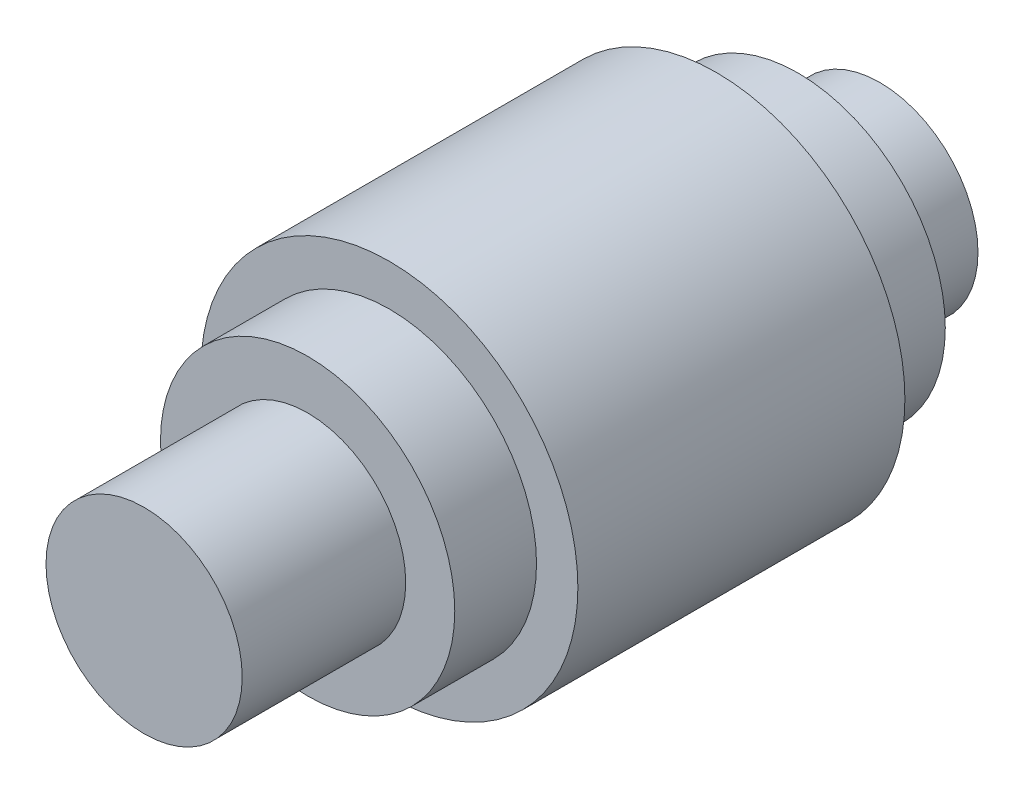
ISO-10303-21;
HEADER;
FILE_DESCRIPTION(('STEP AP214'),'2;1');
FILE_NAME('part.step','',(''),(''),'','','');
FILE_SCHEMA(('AUTOMOTIVE_DESIGN { 1 0 10303 214 1 1 1 1 }'));
ENDSEC;
DATA;
#1=APPLICATION_CONTEXT('core data for automotive mechanical design processes');
#2=APPLICATION_PROTOCOL_DEFINITION('international standard','automotive_design',2000,#1);
#3=PRODUCT_CONTEXT('',#1,'mechanical');
#4=PRODUCT('Part','Part','',(#3));
#5=PRODUCT_RELATED_PRODUCT_CATEGORY('part','',(#4));
#6=PRODUCT_DEFINITION_FORMATION('','',#4);
#7=PRODUCT_DEFINITION_CONTEXT('part definition',#1,'design');
#8=PRODUCT_DEFINITION('design','',#6,#7);
#9=PRODUCT_DEFINITION_SHAPE('','',#8);
#10=(LENGTH_UNIT() NAMED_UNIT(*) SI_UNIT(.MILLI.,.METRE.));
#11=(NAMED_UNIT(*) PLANE_ANGLE_UNIT() SI_UNIT($,.RADIAN.));
#12=(NAMED_UNIT(*) SI_UNIT($,.STERADIAN.) SOLID_ANGLE_UNIT());
#13=UNCERTAINTY_MEASURE_WITH_UNIT(LENGTH_MEASURE(1.E-05),#10,'distance_accuracy_value','');
#14=(GEOMETRIC_REPRESENTATION_CONTEXT(3) GLOBAL_UNCERTAINTY_ASSIGNED_CONTEXT((#13)) GLOBAL_UNIT_ASSIGNED_CONTEXT((#10,
#11,#12)) REPRESENTATION_CONTEXT('',''));
#15=CARTESIAN_POINT('',(0.,0.,0.));
#16=DIRECTION('',(0.,0.,1.));
#17=DIRECTION('',(1.,0.,0.));
#18=AXIS2_PLACEMENT_3D('',#15,#16,#17);
#19=CARTESIAN_POINT('',(0.,0.,20.));
#20=DIRECTION('',(0.,0.,-1.));
#21=DIRECTION('',(-1.,0.,0.));
#22=AXIS2_PLACEMENT_3D('',#19,#20,#21);
#23=CYLINDRICAL_SURFACE('',#22,11.5293024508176);
#24=CARTESIAN_POINT('',(0.,0.,20.));
#25=DIRECTION('',(0.,0.,1.));
#26=DIRECTION('',(1.,0.,0.));
#27=AXIS2_PLACEMENT_3D('',#24,#25,#26);
#28=CIRCLE('',#27,11.5293024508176);
#29=CARTESIAN_POINT('',(11.5293024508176,0.,20.));
#30=VERTEX_POINT('',#29);
#31=EDGE_CURVE('E76',#30,#30,#28,.T.);
#32=ORIENTED_EDGE('',*,*,#31,.F.);
#33=EDGE_LOOP('',(#32));
#34=FACE_BOUND('',#33,.T.);
#35=CARTESIAN_POINT('',(0.,0.,0.));
#36=DIRECTION('',(0.,0.,1.));
#37=DIRECTION('',(1.,0.,0.));
#38=AXIS2_PLACEMENT_3D('',#35,#36,#37);
#39=CIRCLE('',#38,11.5293024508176);
#40=CARTESIAN_POINT('',(11.5293024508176,0.,0.));
#41=VERTEX_POINT('',#40);
#42=EDGE_CURVE('E42',#41,#41,#39,.T.);
#43=ORIENTED_EDGE('',*,*,#42,.T.);
#44=EDGE_LOOP('',(#43));
#45=FACE_BOUND('',#44,.T.);
#46=ADVANCED_FACE('F39',(#34,#45),#23,.T.);
#47=CARTESIAN_POINT('',(0.,0.,20.));
#48=DIRECTION('',(0.,0.,1.));
#49=DIRECTION('',(1.,0.,0.));
#50=AXIS2_PLACEMENT_3D('',#47,#48,#49);
#51=PLANE('',#50);
#52=CARTESIAN_POINT('',(0.,0.,20.));
#53=DIRECTION('',(0.,0.,1.));
#54=DIRECTION('',(1.,0.,0.));
#55=AXIS2_PLACEMENT_3D('',#52,#53,#54);
#56=CIRCLE('',#55,9.);
#57=CARTESIAN_POINT('',(9.,0.,20.));
#58=VERTEX_POINT('',#57);
#59=EDGE_CURVE('E70',#58,#58,#56,.T.);
#60=ORIENTED_EDGE('',*,*,#59,.F.);
#61=EDGE_LOOP('',(#60));
#62=FACE_BOUND('',#61,.T.);
#63=ORIENTED_EDGE('',*,*,#31,.T.);
#64=EDGE_LOOP('',(#63));
#65=FACE_BOUND('',#64,.T.);
#66=ADVANCED_FACE('F89',(#62,#65),#51,.T.);
#67=CARTESIAN_POINT('',(0.,0.,0.));
#68=DIRECTION('',(0.,0.,1.));
#69=DIRECTION('',(1.,0.,0.));
#70=AXIS2_PLACEMENT_3D('',#67,#68,#69);
#71=PLANE('',#70);
#72=CARTESIAN_POINT('',(0.,0.,0.));
#73=DIRECTION('',(0.,0.,-1.));
#74=DIRECTION('',(-1.,0.,0.));
#75=AXIS2_PLACEMENT_3D('',#72,#73,#74);
#76=CIRCLE('',#75,9.);
#77=CARTESIAN_POINT('',(-9.,0.,0.));
#78=VERTEX_POINT('',#77);
#79=EDGE_CURVE('E47',#78,#78,#76,.T.);
#80=ORIENTED_EDGE('',*,*,#79,.F.);
#81=EDGE_LOOP('',(#80));
#82=FACE_BOUND('',#81,.T.);
#83=ORIENTED_EDGE('',*,*,#42,.F.);
#84=EDGE_LOOP('',(#83));
#85=FACE_BOUND('',#84,.T.);
#86=ADVANCED_FACE('F86',(#82,#85),#71,.F.);
#87=CARTESIAN_POINT('',(0.,0.,25.));
#88=DIRECTION('',(0.,0.,-1.));
#89=DIRECTION('',(-1.,0.,0.));
#90=AXIS2_PLACEMENT_3D('',#87,#88,#89);
#91=CYLINDRICAL_SURFACE('',#90,9.);
#92=CARTESIAN_POINT('',(0.,0.,25.));
#93=DIRECTION('',(0.,0.,1.));
#94=DIRECTION('',(1.,0.,0.));
#95=AXIS2_PLACEMENT_3D('',#92,#93,#94);
#96=CIRCLE('',#95,9.);
#97=CARTESIAN_POINT('',(9.,0.,25.));
#98=VERTEX_POINT('',#97);
#99=EDGE_CURVE('E66',#98,#98,#96,.T.);
#100=ORIENTED_EDGE('',*,*,#99,.F.);
#101=EDGE_LOOP('',(#100));
#102=FACE_BOUND('',#101,.T.);
#103=ORIENTED_EDGE('',*,*,#59,.T.);
#104=EDGE_LOOP('',(#103));
#105=FACE_BOUND('',#104,.T.);
#106=ADVANCED_FACE('F88',(#102,#105),#91,.T.);
#107=CARTESIAN_POINT('',(0.,0.,25.));
#108=DIRECTION('',(0.,0.,1.));
#109=DIRECTION('',(1.,0.,0.));
#110=AXIS2_PLACEMENT_3D('',#107,#108,#109);
#111=PLANE('',#110);
#112=CARTESIAN_POINT('',(0.,0.,25.));
#113=DIRECTION('',(0.,0.,1.));
#114=DIRECTION('',(1.,0.,0.));
#115=AXIS2_PLACEMENT_3D('',#112,#113,#114);
#116=CIRCLE('',#115,6.);
#117=CARTESIAN_POINT('',(6.,0.,25.));
#118=VERTEX_POINT('',#117);
#119=EDGE_CURVE('E53',#118,#118,#116,.T.);
#120=ORIENTED_EDGE('',*,*,#119,.F.);
#121=EDGE_LOOP('',(#120));
#122=FACE_BOUND('',#121,.T.);
#123=ORIENTED_EDGE('',*,*,#99,.T.);
#124=EDGE_LOOP('',(#123));
#125=FACE_BOUND('',#124,.T.);
#126=ADVANCED_FACE('F95',(#122,#125),#111,.T.);
#127=CARTESIAN_POINT('',(0.,0.,35.));
#128=DIRECTION('',(0.,0.,-1.));
#129=DIRECTION('',(-1.,0.,0.));
#130=AXIS2_PLACEMENT_3D('',#127,#128,#129);
#131=CYLINDRICAL_SURFACE('',#130,6.);
#132=CARTESIAN_POINT('',(0.,0.,35.));
#133=DIRECTION('',(0.,0.,1.));
#134=DIRECTION('',(1.,0.,0.));
#135=AXIS2_PLACEMENT_3D('',#132,#133,#134);
#136=CIRCLE('',#135,6.);
#137=CARTESIAN_POINT('',(6.,0.,35.));
#138=VERTEX_POINT('',#137);
#139=EDGE_CURVE('E61',#138,#138,#136,.T.);
#140=ORIENTED_EDGE('',*,*,#139,.F.);
#141=EDGE_LOOP('',(#140));
#142=FACE_BOUND('',#141,.T.);
#143=ORIENTED_EDGE('',*,*,#119,.T.);
#144=EDGE_LOOP('',(#143));
#145=FACE_BOUND('',#144,.T.);
#146=ADVANCED_FACE('F125',(#142,#145),#131,.T.);
#147=CARTESIAN_POINT('',(0.,0.,35.));
#148=DIRECTION('',(0.,0.,1.));
#149=DIRECTION('',(1.,0.,0.));
#150=AXIS2_PLACEMENT_3D('',#147,#148,#149);
#151=PLANE('',#150);
#152=ORIENTED_EDGE('',*,*,#139,.T.);
#153=EDGE_LOOP('',(#152));
#154=FACE_BOUND('',#153,.T.);
#155=ADVANCED_FACE('F135',(#154),#151,.T.);
#156=CARTESIAN_POINT('',(0.,0.,-5.));
#157=DIRECTION('',(0.,0.,1.));
#158=DIRECTION('',(1.,0.,0.));
#159=AXIS2_PLACEMENT_3D('',#156,#157,#158);
#160=CYLINDRICAL_SURFACE('',#159,9.);
#161=CARTESIAN_POINT('',(0.,0.,-5.));
#162=DIRECTION('',(0.,0.,-1.));
#163=DIRECTION('',(-1.,0.,0.));
#164=AXIS2_PLACEMENT_3D('',#161,#162,#163);
#165=CIRCLE('',#164,9.);
#166=CARTESIAN_POINT('',(-9.,0.,-5.));
#167=VERTEX_POINT('',#166);
#168=EDGE_CURVE('E58',#167,#167,#165,.T.);
#169=ORIENTED_EDGE('',*,*,#168,.F.);
#170=EDGE_LOOP('',(#169));
#171=FACE_BOUND('',#170,.T.);
#172=ORIENTED_EDGE('',*,*,#79,.T.);
#173=EDGE_LOOP('',(#172));
#174=FACE_BOUND('',#173,.T.);
#175=ADVANCED_FACE('F144',(#171,#174),#160,.T.);
#176=CARTESIAN_POINT('',(0.,0.,-5.));
#177=DIRECTION('',(0.,0.,-1.));
#178=DIRECTION('',(-1.,0.,0.));
#179=AXIS2_PLACEMENT_3D('',#176,#177,#178);
#180=PLANE('',#179);
#181=CARTESIAN_POINT('',(0.,0.,-5.));
#182=DIRECTION('',(0.,0.,-1.));
#183=DIRECTION('',(-1.,0.,0.));
#184=AXIS2_PLACEMENT_3D('',#181,#182,#183);
#185=CIRCLE('',#184,6.);
#186=CARTESIAN_POINT('',(-6.,0.,-5.));
#187=VERTEX_POINT('',#186);
#188=EDGE_CURVE('E10',#187,#187,#185,.T.);
#189=ORIENTED_EDGE('',*,*,#188,.F.);
#190=EDGE_LOOP('',(#189));
#191=FACE_BOUND('',#190,.T.);
#192=ORIENTED_EDGE('',*,*,#168,.T.);
#193=EDGE_LOOP('',(#192));
#194=FACE_BOUND('',#193,.T.);
#195=ADVANCED_FACE('F158',(#191,#194),#180,.T.);
#196=CARTESIAN_POINT('',(0.,0.,-10.));
#197=DIRECTION('',(0.,0.,1.));
#198=DIRECTION('',(1.,0.,0.));
#199=AXIS2_PLACEMENT_3D('',#196,#197,#198);
#200=CYLINDRICAL_SURFACE('',#199,6.);
#201=CARTESIAN_POINT('',(0.,0.,-10.));
#202=DIRECTION('',(0.,0.,-1.));
#203=DIRECTION('',(-1.,0.,0.));
#204=AXIS2_PLACEMENT_3D('',#201,#202,#203);
#205=CIRCLE('',#204,6.);
#206=CARTESIAN_POINT('',(-6.,0.,-10.));
#207=VERTEX_POINT('',#206);
#208=EDGE_CURVE('E57',#207,#207,#205,.T.);
#209=ORIENTED_EDGE('',*,*,#208,.F.);
#210=EDGE_LOOP('',(#209));
#211=FACE_BOUND('',#210,.T.);
#212=ORIENTED_EDGE('',*,*,#188,.T.);
#213=EDGE_LOOP('',(#212));
#214=FACE_BOUND('',#213,.T.);
#215=ADVANCED_FACE('F168',(#211,#214),#200,.T.);
#216=CARTESIAN_POINT('',(0.,0.,-10.));
#217=DIRECTION('',(0.,0.,-1.));
#218=DIRECTION('',(-1.,0.,0.));
#219=AXIS2_PLACEMENT_3D('',#216,#217,#218);
#220=PLANE('',#219);
#221=ORIENTED_EDGE('',*,*,#208,.T.);
#222=EDGE_LOOP('',(#221));
#223=FACE_BOUND('',#222,.T.);
#224=ADVANCED_FACE('F178',(#223),#220,.T.);
#225=CLOSED_SHELL('',(#46,#66,#86,#106,#126,#146,#155,#175,#195,#215,#224));
#226=MANIFOLD_SOLID_BREP('B2',#225);
#227=ADVANCED_BREP_SHAPE_REPRESENTATION('',(#18,#226),#14);
#228=SHAPE_DEFINITION_REPRESENTATION(#9,#227);
ENDSEC;
END-ISO-10303-21;
